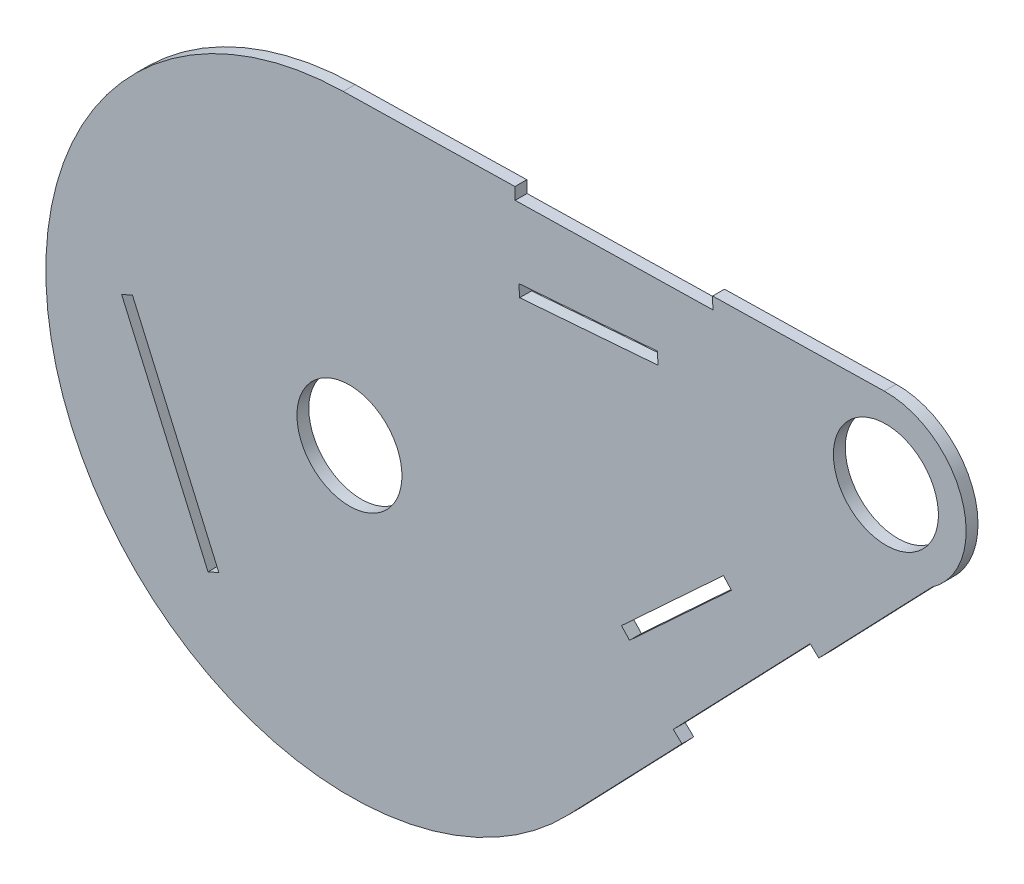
ISO-10303-21;
HEADER;
FILE_DESCRIPTION(('STEP AP214'),'2;1');
FILE_NAME('part.step','',(''),(''),'','','');
FILE_SCHEMA(('AUTOMOTIVE_DESIGN { 1 0 10303 214 1 1 1 1 }'));
ENDSEC;
DATA;
#1=APPLICATION_CONTEXT('core data for automotive mechanical design processes');
#2=APPLICATION_PROTOCOL_DEFINITION('international standard','automotive_design',2000,#1);
#3=PRODUCT_CONTEXT('',#1,'mechanical');
#4=PRODUCT('Part','Part','',(#3));
#5=PRODUCT_RELATED_PRODUCT_CATEGORY('part','',(#4));
#6=PRODUCT_DEFINITION_FORMATION('','',#4);
#7=PRODUCT_DEFINITION_CONTEXT('part definition',#1,'design');
#8=PRODUCT_DEFINITION('design','',#6,#7);
#9=PRODUCT_DEFINITION_SHAPE('','',#8);
#10=(LENGTH_UNIT() NAMED_UNIT(*) SI_UNIT(.MILLI.,.METRE.));
#11=(NAMED_UNIT(*) PLANE_ANGLE_UNIT() SI_UNIT($,.RADIAN.));
#12=(NAMED_UNIT(*) SI_UNIT($,.STERADIAN.) SOLID_ANGLE_UNIT());
#13=UNCERTAINTY_MEASURE_WITH_UNIT(LENGTH_MEASURE(1.E-05),#10,'distance_accuracy_value','');
#14=(GEOMETRIC_REPRESENTATION_CONTEXT(3) GLOBAL_UNCERTAINTY_ASSIGNED_CONTEXT((#13)) GLOBAL_UNIT_ASSIGNED_CONTEXT((#10,
#11,#12)) REPRESENTATION_CONTEXT('',''));
#15=CARTESIAN_POINT('',(0.,0.,0.));
#16=DIRECTION('',(0.,0.,1.));
#17=DIRECTION('',(1.,0.,0.));
#18=AXIS2_PLACEMENT_3D('',#15,#16,#17);
#19=CARTESIAN_POINT('',(9.258899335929,5.40182579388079,1.524));
#20=DIRECTION('',(0.020329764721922,-0.99979332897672,0.));
#21=DIRECTION('',(0.99979332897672,0.020329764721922,0.));
#22=AXIS2_PLACEMENT_3D('',#19,#20,#21);
#23=PLANE('',#22);
#24=DIRECTION('',(-0.99979332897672,-0.020329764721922,0.));
#25=VECTOR('',#24,1.);
#26=CARTESIAN_POINT('',(9.258899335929,5.40182579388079,0.));
#27=LINE('',#26,#25);
#28=CARTESIAN_POINT('',(9.258899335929,5.40182579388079,0.));
#29=VERTEX_POINT('',#28);
#30=CARTESIAN_POINT('',(-12.7962234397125,4.95335765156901,0.));
#31=VERTEX_POINT('',#30);
#32=EDGE_CURVE('E377',#29,#31,#27,.T.);
#33=ORIENTED_EDGE('',*,*,#32,.T.);
#34=DIRECTION('',(0.,0.,1.));
#35=VECTOR('',#34,1.);
#36=CARTESIAN_POINT('',(-12.7962234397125,4.95335765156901,0.));
#37=LINE('',#36,#35);
#38=CARTESIAN_POINT('',(-12.7962234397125,4.95335765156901,1.524));
#39=VERTEX_POINT('',#38);
#40=EDGE_CURVE('E225',#31,#39,#37,.T.);
#41=ORIENTED_EDGE('',*,*,#40,.T.);
#42=DIRECTION('',(-0.99979332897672,-0.020329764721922,0.));
#43=VECTOR('',#42,1.);
#44=CARTESIAN_POINT('',(9.258899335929,5.40182579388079,1.524));
#45=LINE('',#44,#43);
#46=CARTESIAN_POINT('',(9.258899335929,5.40182579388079,1.524));
#47=VERTEX_POINT('',#46);
#48=EDGE_CURVE('E365',#47,#39,#45,.T.);
#49=ORIENTED_EDGE('',*,*,#48,.F.);
#50=DIRECTION('',(0.,0.,-1.));
#51=VECTOR('',#50,1.);
#52=CARTESIAN_POINT('',(9.258899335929,5.40182579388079,1.524));
#53=LINE('',#52,#51);
#54=EDGE_CURVE('E11',#47,#29,#53,.T.);
#55=ORIENTED_EDGE('',*,*,#54,.T.);
#56=EDGE_LOOP('',(#33,#41,#49,#55));
#57=FACE_BOUND('',#56,.T.);
#58=ADVANCED_FACE('F34',(#57),#23,.F.);
#59=CARTESIAN_POINT('',(15.4024708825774,-13.3349100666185,1.524));
#60=DIRECTION('',(-0.721594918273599,0.692315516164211,0.));
#61=DIRECTION('',(-0.692315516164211,-0.721594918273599,0.));
#62=AXIS2_PLACEMENT_3D('',#59,#60,#61);
#63=PLANE('',#62);
#64=DIRECTION('',(0.692315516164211,0.721594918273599,0.));
#65=VECTOR('',#64,1.);
#66=CARTESIAN_POINT('',(15.4024708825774,-13.3349100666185,0.));
#67=LINE('',#66,#65);
#68=CARTESIAN_POINT('',(-31.3049279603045,-62.0176578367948,0.));
#69=VERTEX_POINT('',#68);
#70=CARTESIAN_POINT('',(-16.7436355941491,-46.8405394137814,0.));
#71=VERTEX_POINT('',#70);
#72=EDGE_CURVE('E364',#69,#71,#67,.T.);
#73=ORIENTED_EDGE('',*,*,#72,.T.);
#74=DIRECTION('',(0.,0.,1.));
#75=VECTOR('',#74,1.);
#76=CARTESIAN_POINT('',(-16.7436355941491,-46.8405394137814,0.));
#77=LINE('',#76,#75);
#78=CARTESIAN_POINT('',(-16.7436355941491,-46.8405394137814,1.524));
#79=VERTEX_POINT('',#78);
#80=EDGE_CURVE('E246',#71,#79,#77,.T.);
#81=ORIENTED_EDGE('',*,*,#80,.T.);
#82=DIRECTION('',(0.692315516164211,0.721594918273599,0.));
#83=VECTOR('',#82,1.);
#84=CARTESIAN_POINT('',(15.4024708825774,-13.3349100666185,1.524));
#85=LINE('',#84,#83);
#86=CARTESIAN_POINT('',(-31.3049279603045,-62.0176578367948,1.524));
#87=VERTEX_POINT('',#86);
#88=EDGE_CURVE('E371',#87,#79,#85,.T.);
#89=ORIENTED_EDGE('',*,*,#88,.F.);
#90=DIRECTION('',(0.,0.,-1.));
#91=VECTOR('',#90,1.);
#92=CARTESIAN_POINT('',(-31.3049279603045,-62.0176578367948,1.524));
#93=LINE('',#92,#91);
#94=EDGE_CURVE('E387',#87,#69,#93,.T.);
#95=ORIENTED_EDGE('',*,*,#94,.T.);
#96=EDGE_LOOP('',(#73,#81,#89,#95));
#97=FACE_BOUND('',#96,.T.);
#98=ADVANCED_FACE('F400',(#97),#63,.F.);
#99=CARTESIAN_POINT('',(9.46847857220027,-4.90502847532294,1.524));
#100=DIRECTION('',(0.,0.,1.));
#101=DIRECTION('',(1.,0.,0.));
#102=AXIS2_PLACEMENT_3D('',#99,#100,#101);
#103=PLANE('',#102);
#104=DIRECTION('',(-0.0203297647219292,0.99979332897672,0.));
#105=VECTOR('',#104,1.);
#106=CARTESIAN_POINT('',(-12.7962234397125,4.95335765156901,1.524));
#107=LINE('',#106,#105);
#108=CARTESIAN_POINT('',(-12.7652408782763,3.42967261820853,1.524));
#109=VERTEX_POINT('',#108);
#110=EDGE_CURVE('E217',#109,#39,#107,.T.);
#111=ORIENTED_EDGE('',*,*,#110,.F.);
#112=DIRECTION('',(0.99979332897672,0.0203297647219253,0.));
#113=VECTOR('',#112,1.);
#114=CARTESIAN_POINT('',(-38.159991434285,2.91329659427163,1.524));
#115=LINE('',#114,#113);
#116=CARTESIAN_POINT('',(-38.159991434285,2.91329659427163,1.524));
#117=VERTEX_POINT('',#116);
#118=EDGE_CURVE('E219',#117,#109,#115,.T.);
#119=ORIENTED_EDGE('',*,*,#118,.F.);
#120=DIRECTION('',(0.0203297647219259,-0.99979332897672,0.));
#121=VECTOR('',#120,1.);
#122=CARTESIAN_POINT('',(-38.1909739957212,4.43698162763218,1.524));
#123=LINE('',#122,#121);
#124=CARTESIAN_POINT('',(-38.1909739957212,4.43698162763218,1.524));
#125=VERTEX_POINT('',#124);
#126=EDGE_CURVE('E197',#125,#117,#123,.T.);
#127=ORIENTED_EDGE('',*,*,#126,.F.);
#128=CARTESIAN_POINT('',(-60.2460967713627,3.98851348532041,1.524));
#129=VERTEX_POINT('',#128);
#130=EDGE_CURVE('E363',#125,#129,#45,.T.);
#131=ORIENTED_EDGE('',*,*,#130,.T.);
#132=CARTESIAN_POINT('',(-59.4530686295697,-35.0116548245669,1.524));
#133=DIRECTION('',(0.,0.,1.));
#134=DIRECTION('',(1.,0.,0.));
#135=AXIS2_PLACEMENT_3D('',#132,#133,#134);
#136=CIRCLE('',#135,39.0082301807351);
#137=EDGE_CURVE('E368',#129,#87,#136,.T.);
#138=ORIENTED_EDGE('',*,*,#137,.T.);
#139=ORIENTED_EDGE('',*,*,#88,.T.);
#140=DIRECTION('',(0.721594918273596,-0.692315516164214,0.));
#141=VECTOR('',#140,1.);
#142=CARTESIAN_POINT('',(-16.7436355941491,-46.8405394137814,1.524));
#143=LINE('',#142,#141);
#144=CARTESIAN_POINT('',(-17.843346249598,-45.7854505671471,1.524));
#145=VERTEX_POINT('',#144);
#146=EDGE_CURVE('E233',#145,#79,#143,.T.);
#147=ORIENTED_EDGE('',*,*,#146,.F.);
#148=DIRECTION('',(-0.692315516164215,-0.721594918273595,0.));
#149=VECTOR('',#148,1.);
#150=CARTESIAN_POINT('',(-0.258532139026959,-27.4569396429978,1.524));
#151=LINE('',#150,#149);
#152=CARTESIAN_POINT('',(-0.258532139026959,-27.4569396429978,1.524));
#153=VERTEX_POINT('',#152);
#154=EDGE_CURVE('E242',#153,#145,#151,.T.);
#155=ORIENTED_EDGE('',*,*,#154,.F.);
#156=DIRECTION('',(-0.721594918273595,0.692315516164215,0.));
#157=VECTOR('',#156,1.);
#158=CARTESIAN_POINT('',(0.841178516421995,-28.512028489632,1.524));
#159=LINE('',#158,#157);
#160=CARTESIAN_POINT('',(0.841178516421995,-28.512028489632,1.524));
#161=VERTEX_POINT('',#160);
#162=EDGE_CURVE('E228',#161,#153,#159,.T.);
#163=ORIENTED_EDGE('',*,*,#162,.F.);
#164=CARTESIAN_POINT('',(15.4024708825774,-13.3349100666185,1.524));
#165=VERTEX_POINT('',#164);
#166=EDGE_CURVE('E370',#161,#165,#85,.T.);
#167=ORIENTED_EDGE('',*,*,#166,.T.);
#168=CARTESIAN_POINT('',(9.46847857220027,-4.90502847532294,1.524));
#169=DIRECTION('',(0.,0.,1.));
#170=DIRECTION('',(1.,0.,0.));
#171=AXIS2_PLACEMENT_3D('',#168,#169,#170);
#172=CIRCLE('',#171,10.3089848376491);
#173=EDGE_CURVE('E360',#165,#47,#172,.T.);
#174=ORIENTED_EDGE('',*,*,#173,.T.);
#175=ORIENTED_EDGE('',*,*,#48,.T.);
#176=EDGE_LOOP('',(#111,#119,#127,#131,#138,#139,#147,#155,#163,#167,#174,#175));
#177=FACE_BOUND('',#176,.T.);
#178=DIRECTION('',(-0.734074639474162,-0.679068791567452,0.));
#179=VECTOR('',#178,1.);
#180=CARTESIAN_POINT('',(-11.4028544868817,-25.4543079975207,1.524));
#181=LINE('',#180,#179);
#182=CARTESIAN_POINT('',(-11.4028544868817,-25.4543079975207,1.524));
#183=VERTEX_POINT('',#182);
#184=CARTESIAN_POINT('',(-24.5028269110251,-37.5726703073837,1.524));
#185=VERTEX_POINT('',#184);
#186=EDGE_CURVE('E288',#183,#185,#181,.T.);
#187=ORIENTED_EDGE('',*,*,#186,.F.);
#188=DIRECTION('',(-0.679068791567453,0.734074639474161,0.));
#189=VECTOR('',#188,1.);
#190=CARTESIAN_POINT('',(-11.4028544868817,-25.4543079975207,1.524));
#191=LINE('',#190,#189);
#192=CARTESIAN_POINT('',(-10.3679536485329,-26.5730377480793,1.524));
#193=VERTEX_POINT('',#192);
#194=EDGE_CURVE('E286',#193,#183,#191,.T.);
#195=ORIENTED_EDGE('',*,*,#194,.F.);
#196=DIRECTION('',(0.734074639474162,0.679068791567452,0.));
#197=VECTOR('',#196,1.);
#198=CARTESIAN_POINT('',(-10.3679536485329,-26.5730377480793,1.524));
#199=LINE('',#198,#197);
#200=CARTESIAN_POINT('',(-23.4679260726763,-38.6914000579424,1.524));
#201=VERTEX_POINT('',#200);
#202=EDGE_CURVE('E294',#201,#193,#199,.T.);
#203=ORIENTED_EDGE('',*,*,#202,.F.);
#204=DIRECTION('',(0.679068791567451,-0.734074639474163,0.));
#205=VECTOR('',#204,1.);
#206=CARTESIAN_POINT('',(-24.5028269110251,-37.5726703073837,1.524));
#207=LINE('',#206,#205);
#208=EDGE_CURVE('E291',#185,#201,#207,.T.);
#209=ORIENTED_EDGE('',*,*,#208,.F.);
#210=EDGE_LOOP('',(#187,#195,#203,#209));
#211=FACE_BOUND('',#210,.T.);
#212=DIRECTION('',(-0.0771168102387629,0.997022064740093,0.));
#213=VECTOR('',#212,1.);
#214=CARTESIAN_POINT('',(-19.7901339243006,-6.2537416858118,1.524));
#215=LINE('',#214,#213);
#216=CARTESIAN_POINT('',(-19.7901339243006,-6.2537416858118,1.524));
#217=VERTEX_POINT('',#216);
#218=CARTESIAN_POINT('',(-19.9076599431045,-4.73428005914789,1.524));
#219=VERTEX_POINT('',#218);
#220=EDGE_CURVE('E325',#217,#219,#215,.T.);
#221=ORIENTED_EDGE('',*,*,#220,.F.);
#222=DIRECTION('',(0.997022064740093,0.0771168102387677,0.));
#223=VECTOR('',#222,1.);
#224=CARTESIAN_POINT('',(-19.7901339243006,-6.2537416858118,1.524));
#225=LINE('',#224,#223);
#226=CARTESIAN_POINT('',(-37.5825501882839,-7.62993428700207,1.524));
#227=VERTEX_POINT('',#226);
#228=EDGE_CURVE('E323',#227,#217,#225,.T.);
#229=ORIENTED_EDGE('',*,*,#228,.F.);
#230=DIRECTION('',(0.0771168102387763,-0.997022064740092,0.));
#231=VECTOR('',#230,1.);
#232=CARTESIAN_POINT('',(-37.5825501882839,-7.62993428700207,1.524));
#233=LINE('',#232,#231);
#234=CARTESIAN_POINT('',(-37.7000762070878,-6.11047266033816,1.524));
#235=VERTEX_POINT('',#234);
#236=EDGE_CURVE('E331',#235,#227,#233,.T.);
#237=ORIENTED_EDGE('',*,*,#236,.F.);
#238=DIRECTION('',(-0.997022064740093,-0.0771168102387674,0.));
#239=VECTOR('',#238,1.);
#240=CARTESIAN_POINT('',(-19.9076599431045,-4.73428005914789,1.524));
#241=LINE('',#240,#239);
#242=EDGE_CURVE('E328',#219,#235,#241,.T.);
#243=ORIENTED_EDGE('',*,*,#242,.F.);
#244=EDGE_LOOP('',(#221,#229,#237,#243));
#245=FACE_BOUND('',#244,.T.);
#246=CARTESIAN_POINT('',(9.46847857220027,-4.90502847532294,1.524));
#247=DIRECTION('',(0.,0.,1.));
#248=DIRECTION('',(1.,0.,0.));
#249=AXIS2_PLACEMENT_3D('',#246,#247,#248);
#250=CIRCLE('',#249,6.7437);
#251=CARTESIAN_POINT('',(2.72477857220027,-4.90502847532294,1.524));
#252=VERTEX_POINT('',#251);
#253=EDGE_CURVE('E354',#252,#252,#250,.T.);
#254=ORIENTED_EDGE('',*,*,#253,.F.);
#255=EDGE_LOOP('',(#254));
#256=FACE_BOUND('',#255,.T.);
#257=CARTESIAN_POINT('',(-59.4530686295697,-35.0116548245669,1.524));
#258=DIRECTION('',(0.,0.,1.));
#259=DIRECTION('',(1.,0.,0.));
#260=AXIS2_PLACEMENT_3D('',#257,#258,#259);
#261=CIRCLE('',#260,6.7437);
#262=CARTESIAN_POINT('',(-66.1967686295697,-35.0116548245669,1.524));
#263=VERTEX_POINT('',#262);
#264=EDGE_CURVE('E317',#263,#263,#261,.T.);
#265=ORIENTED_EDGE('',*,*,#264,.F.);
#266=EDGE_LOOP('',(#265));
#267=FACE_BOUND('',#266,.T.);
#268=DIRECTION('',(0.401557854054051,-0.915833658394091,0.));
#269=VECTOR('',#268,1.);
#270=CARTESIAN_POINT('',(-88.7233799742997,-32.8297260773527,1.524));
#271=LINE('',#270,#269);
#272=CARTESIAN_POINT('',(-88.7233799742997,-32.8297260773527,1.524));
#273=VERTEX_POINT('',#272);
#274=CARTESIAN_POINT('',(-77.6222617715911,-58.1480646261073,1.524));
#275=VERTEX_POINT('',#274);
#276=EDGE_CURVE('E257',#273,#275,#271,.T.);
#277=ORIENTED_EDGE('',*,*,#276,.F.);
#278=DIRECTION('',(-0.915833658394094,-0.401557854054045,0.));
#279=VECTOR('',#278,1.);
#280=CARTESIAN_POINT('',(-88.7233799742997,-32.8297260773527,1.524));
#281=LINE('',#280,#279);
#282=CARTESIAN_POINT('',(-87.3276494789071,-32.2177519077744,1.524));
#283=VERTEX_POINT('',#282);
#284=EDGE_CURVE('E255',#283,#273,#281,.T.);
#285=ORIENTED_EDGE('',*,*,#284,.F.);
#286=DIRECTION('',(-0.401557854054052,0.915833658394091,0.));
#287=VECTOR('',#286,1.);
#288=CARTESIAN_POINT('',(-87.3276494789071,-32.2177519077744,1.524));
#289=LINE('',#288,#287);
#290=CARTESIAN_POINT('',(-76.2265312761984,-57.536090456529,1.524));
#291=VERTEX_POINT('',#290);
#292=EDGE_CURVE('E263',#291,#283,#289,.T.);
#293=ORIENTED_EDGE('',*,*,#292,.F.);
#294=DIRECTION('',(0.915833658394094,0.401557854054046,0.));
#295=VECTOR('',#294,1.);
#296=CARTESIAN_POINT('',(-77.6222617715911,-58.1480646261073,1.524));
#297=LINE('',#296,#295);
#298=EDGE_CURVE('E260',#275,#291,#297,.T.);
#299=ORIENTED_EDGE('',*,*,#298,.F.);
#300=EDGE_LOOP('',(#277,#285,#293,#299));
#301=FACE_BOUND('',#300,.T.);
#302=ADVANCED_FACE('F405',(#177,#211,#245,#256,#267,#301),#103,.T.);
#303=CARTESIAN_POINT('',(9.46847857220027,-4.90502847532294,0.));
#304=DIRECTION('',(0.,0.,1.));
#305=DIRECTION('',(1.,0.,0.));
#306=AXIS2_PLACEMENT_3D('',#303,#304,#305);
#307=PLANE('',#306);
#308=DIRECTION('',(-0.679068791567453,0.734074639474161,0.));
#309=VECTOR('',#308,1.);
#310=CARTESIAN_POINT('',(-11.4028544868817,-25.4543079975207,0.));
#311=LINE('',#310,#309);
#312=CARTESIAN_POINT('',(-10.3679536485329,-26.5730377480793,0.));
#313=VERTEX_POINT('',#312);
#314=CARTESIAN_POINT('',(-11.4028544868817,-25.4543079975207,0.));
#315=VERTEX_POINT('',#314);
#316=EDGE_CURVE('E285',#313,#315,#311,.T.);
#317=ORIENTED_EDGE('',*,*,#316,.T.);
#318=DIRECTION('',(-0.734074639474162,-0.679068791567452,0.));
#319=VECTOR('',#318,1.);
#320=CARTESIAN_POINT('',(-11.4028544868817,-25.4543079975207,0.));
#321=LINE('',#320,#319);
#322=CARTESIAN_POINT('',(-24.5028269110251,-37.5726703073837,0.));
#323=VERTEX_POINT('',#322);
#324=EDGE_CURVE('E299',#315,#323,#321,.T.);
#325=ORIENTED_EDGE('',*,*,#324,.T.);
#326=DIRECTION('',(0.679068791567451,-0.734074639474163,0.));
#327=VECTOR('',#326,1.);
#328=CARTESIAN_POINT('',(-24.5028269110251,-37.5726703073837,0.));
#329=LINE('',#328,#327);
#330=CARTESIAN_POINT('',(-23.4679260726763,-38.6914000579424,0.));
#331=VERTEX_POINT('',#330);
#332=EDGE_CURVE('E302',#323,#331,#329,.T.);
#333=ORIENTED_EDGE('',*,*,#332,.T.);
#334=DIRECTION('',(0.734074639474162,0.679068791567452,0.));
#335=VECTOR('',#334,1.);
#336=CARTESIAN_POINT('',(-10.3679536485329,-26.5730377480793,0.));
#337=LINE('',#336,#335);
#338=EDGE_CURVE('E289',#331,#313,#337,.T.);
#339=ORIENTED_EDGE('',*,*,#338,.T.);
#340=EDGE_LOOP('',(#317,#325,#333,#339));
#341=FACE_BOUND('',#340,.T.);
#342=DIRECTION('',(0.997022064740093,0.0771168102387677,0.));
#343=VECTOR('',#342,1.);
#344=CARTESIAN_POINT('',(-19.7901339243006,-6.2537416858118,0.));
#345=LINE('',#344,#343);
#346=CARTESIAN_POINT('',(-37.5825501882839,-7.62993428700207,0.));
#347=VERTEX_POINT('',#346);
#348=CARTESIAN_POINT('',(-19.7901339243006,-6.2537416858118,0.));
#349=VERTEX_POINT('',#348);
#350=EDGE_CURVE('E320',#347,#349,#345,.T.);
#351=ORIENTED_EDGE('',*,*,#350,.T.);
#352=DIRECTION('',(-0.0771168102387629,0.997022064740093,0.));
#353=VECTOR('',#352,1.);
#354=CARTESIAN_POINT('',(-19.7901339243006,-6.2537416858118,0.));
#355=LINE('',#354,#353);
#356=CARTESIAN_POINT('',(-19.9076599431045,-4.73428005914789,0.));
#357=VERTEX_POINT('',#356);
#358=EDGE_CURVE('E336',#349,#357,#355,.T.);
#359=ORIENTED_EDGE('',*,*,#358,.T.);
#360=DIRECTION('',(-0.997022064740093,-0.0771168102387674,0.));
#361=VECTOR('',#360,1.);
#362=CARTESIAN_POINT('',(-19.9076599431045,-4.73428005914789,0.));
#363=LINE('',#362,#361);
#364=CARTESIAN_POINT('',(-37.7000762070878,-6.11047266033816,0.));
#365=VERTEX_POINT('',#364);
#366=EDGE_CURVE('E339',#357,#365,#363,.T.);
#367=ORIENTED_EDGE('',*,*,#366,.T.);
#368=DIRECTION('',(0.0771168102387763,-0.997022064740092,0.));
#369=VECTOR('',#368,1.);
#370=CARTESIAN_POINT('',(-37.5825501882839,-7.62993428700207,0.));
#371=LINE('',#370,#369);
#372=EDGE_CURVE('E326',#365,#347,#371,.T.);
#373=ORIENTED_EDGE('',*,*,#372,.T.);
#374=EDGE_LOOP('',(#351,#359,#367,#373));
#375=FACE_BOUND('',#374,.T.);
#376=DIRECTION('',(0.99979332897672,0.0203297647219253,0.));
#377=VECTOR('',#376,1.);
#378=CARTESIAN_POINT('',(-38.159991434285,2.91329659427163,0.));
#379=LINE('',#378,#377);
#380=CARTESIAN_POINT('',(-38.159991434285,2.91329659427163,0.));
#381=VERTEX_POINT('',#380);
#382=CARTESIAN_POINT('',(-12.7652408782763,3.42967261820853,0.));
#383=VERTEX_POINT('',#382);
#384=EDGE_CURVE('E205',#381,#383,#379,.T.);
#385=ORIENTED_EDGE('',*,*,#384,.T.);
#386=DIRECTION('',(-0.0203297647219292,0.99979332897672,0.));
#387=VECTOR('',#386,1.);
#388=CARTESIAN_POINT('',(-12.7962234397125,4.95335765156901,0.));
#389=LINE('',#388,#387);
#390=EDGE_CURVE('E210',#383,#31,#389,.T.);
#391=ORIENTED_EDGE('',*,*,#390,.T.);
#392=ORIENTED_EDGE('',*,*,#32,.F.);
#393=CARTESIAN_POINT('',(9.46847857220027,-4.90502847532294,0.));
#394=DIRECTION('',(0.,0.,1.));
#395=DIRECTION('',(1.,0.,0.));
#396=AXIS2_PLACEMENT_3D('',#393,#394,#395);
#397=CIRCLE('',#396,10.3089848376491);
#398=CARTESIAN_POINT('',(15.4024708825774,-13.3349100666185,0.));
#399=VERTEX_POINT('',#398);
#400=EDGE_CURVE('E357',#399,#29,#397,.T.);
#401=ORIENTED_EDGE('',*,*,#400,.F.);
#402=CARTESIAN_POINT('',(0.841178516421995,-28.5120284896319,0.));
#403=VERTEX_POINT('',#402);
#404=EDGE_CURVE('E382',#403,#399,#67,.T.);
#405=ORIENTED_EDGE('',*,*,#404,.F.);
#406=DIRECTION('',(-0.721594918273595,0.692315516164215,0.));
#407=VECTOR('',#406,1.);
#408=CARTESIAN_POINT('',(0.841178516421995,-28.512028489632,0.));
#409=LINE('',#408,#407);
#410=CARTESIAN_POINT('',(-0.258532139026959,-27.4569396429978,0.));
#411=VERTEX_POINT('',#410);
#412=EDGE_CURVE('E57',#403,#411,#409,.T.);
#413=ORIENTED_EDGE('',*,*,#412,.T.);
#414=DIRECTION('',(-0.692315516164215,-0.721594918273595,0.));
#415=VECTOR('',#414,1.);
#416=CARTESIAN_POINT('',(-0.258532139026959,-27.4569396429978,0.));
#417=LINE('',#416,#415);
#418=CARTESIAN_POINT('',(-17.843346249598,-45.7854505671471,0.));
#419=VERTEX_POINT('',#418);
#420=EDGE_CURVE('E232',#411,#419,#417,.T.);
#421=ORIENTED_EDGE('',*,*,#420,.T.);
#422=DIRECTION('',(0.721594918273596,-0.692315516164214,0.));
#423=VECTOR('',#422,1.);
#424=CARTESIAN_POINT('',(-16.7436355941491,-46.8405394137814,0.));
#425=LINE('',#424,#423);
#426=EDGE_CURVE('E236',#419,#71,#425,.T.);
#427=ORIENTED_EDGE('',*,*,#426,.T.);
#428=ORIENTED_EDGE('',*,*,#72,.F.);
#429=CARTESIAN_POINT('',(-59.4530686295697,-35.0116548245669,0.));
#430=DIRECTION('',(0.,0.,1.));
#431=DIRECTION('',(1.,0.,0.));
#432=AXIS2_PLACEMENT_3D('',#429,#430,#431);
#433=CIRCLE('',#432,39.0082301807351);
#434=CARTESIAN_POINT('',(-60.2460967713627,3.98851348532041,0.));
#435=VERTEX_POINT('',#434);
#436=EDGE_CURVE('E380',#435,#69,#433,.T.);
#437=ORIENTED_EDGE('',*,*,#436,.F.);
#438=CARTESIAN_POINT('',(-38.1909739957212,4.4369816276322,0.));
#439=VERTEX_POINT('',#438);
#440=EDGE_CURVE('E216',#439,#435,#27,.T.);
#441=ORIENTED_EDGE('',*,*,#440,.F.);
#442=DIRECTION('',(0.0203297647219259,-0.99979332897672,0.));
#443=VECTOR('',#442,1.);
#444=CARTESIAN_POINT('',(-38.1909739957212,4.43698162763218,0.));
#445=LINE('',#444,#443);
#446=EDGE_CURVE('E49',#439,#381,#445,.T.);
#447=ORIENTED_EDGE('',*,*,#446,.T.);
#448=EDGE_LOOP('',(#385,#391,#392,#401,#405,#413,#421,#427,#428,#437,#441,#447));
#449=FACE_BOUND('',#448,.T.);
#450=CARTESIAN_POINT('',(9.46847857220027,-4.90502847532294,0.));
#451=DIRECTION('',(0.,0.,1.));
#452=DIRECTION('',(1.,0.,0.));
#453=AXIS2_PLACEMENT_3D('',#450,#451,#452);
#454=CIRCLE('',#453,6.7437);
#455=CARTESIAN_POINT('',(2.72477857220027,-4.90502847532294,0.));
#456=VERTEX_POINT('',#455);
#457=EDGE_CURVE('E353',#456,#456,#454,.T.);
#458=ORIENTED_EDGE('',*,*,#457,.T.);
#459=EDGE_LOOP('',(#458));
#460=FACE_BOUND('',#459,.T.);
#461=CARTESIAN_POINT('',(-59.4530686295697,-35.0116548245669,0.));
#462=DIRECTION('',(0.,0.,1.));
#463=DIRECTION('',(1.,0.,0.));
#464=AXIS2_PLACEMENT_3D('',#461,#462,#463);
#465=CIRCLE('',#464,6.7437);
#466=CARTESIAN_POINT('',(-66.1967686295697,-35.0116548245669,0.));
#467=VERTEX_POINT('',#466);
#468=EDGE_CURVE('E316',#467,#467,#465,.T.);
#469=ORIENTED_EDGE('',*,*,#468,.T.);
#470=EDGE_LOOP('',(#469));
#471=FACE_BOUND('',#470,.T.);
#472=DIRECTION('',(-0.915833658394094,-0.401557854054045,0.));
#473=VECTOR('',#472,1.);
#474=CARTESIAN_POINT('',(-88.7233799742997,-32.8297260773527,0.));
#475=LINE('',#474,#473);
#476=CARTESIAN_POINT('',(-87.3276494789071,-32.2177519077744,0.));
#477=VERTEX_POINT('',#476);
#478=CARTESIAN_POINT('',(-88.7233799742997,-32.8297260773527,0.));
#479=VERTEX_POINT('',#478);
#480=EDGE_CURVE('E249',#477,#479,#475,.T.);
#481=ORIENTED_EDGE('',*,*,#480,.T.);
#482=DIRECTION('',(0.401557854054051,-0.915833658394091,0.));
#483=VECTOR('',#482,1.);
#484=CARTESIAN_POINT('',(-88.7233799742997,-32.8297260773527,0.));
#485=LINE('',#484,#483);
#486=CARTESIAN_POINT('',(-77.6222617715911,-58.1480646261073,0.));
#487=VERTEX_POINT('',#486);
#488=EDGE_CURVE('E268',#479,#487,#485,.T.);
#489=ORIENTED_EDGE('',*,*,#488,.T.);
#490=DIRECTION('',(0.915833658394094,0.401557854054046,0.));
#491=VECTOR('',#490,1.);
#492=CARTESIAN_POINT('',(-77.6222617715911,-58.1480646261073,0.));
#493=LINE('',#492,#491);
#494=CARTESIAN_POINT('',(-76.2265312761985,-57.536090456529,0.));
#495=VERTEX_POINT('',#494);
#496=EDGE_CURVE('E271',#487,#495,#493,.T.);
#497=ORIENTED_EDGE('',*,*,#496,.T.);
#498=DIRECTION('',(-0.401557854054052,0.915833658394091,0.));
#499=VECTOR('',#498,1.);
#500=CARTESIAN_POINT('',(-87.3276494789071,-32.2177519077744,0.));
#501=LINE('',#500,#499);
#502=EDGE_CURVE('E258',#495,#477,#501,.T.);
#503=ORIENTED_EDGE('',*,*,#502,.T.);
#504=EDGE_LOOP('',(#481,#489,#497,#503));
#505=FACE_BOUND('',#504,.T.);
#506=ADVANCED_FACE('F213',(#341,#375,#449,#460,#471,#505),#307,.F.);
#507=CARTESIAN_POINT('',(9.46847857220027,-4.90502847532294,1.524));
#508=DIRECTION('',(0.,0.,-1.));
#509=DIRECTION('',(-1.,0.,0.));
#510=AXIS2_PLACEMENT_3D('',#507,#508,#509);
#511=CYLINDRICAL_SURFACE('',#510,10.3089848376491);
#512=ORIENTED_EDGE('',*,*,#400,.T.);
#513=ORIENTED_EDGE('',*,*,#54,.F.);
#514=ORIENTED_EDGE('',*,*,#173,.F.);
#515=DIRECTION('',(0.,0.,-1.));
#516=VECTOR('',#515,1.);
#517=CARTESIAN_POINT('',(15.4024708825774,-13.3349100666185,1.524));
#518=LINE('',#517,#516);
#519=EDGE_CURVE('E374',#165,#399,#518,.T.);
#520=ORIENTED_EDGE('',*,*,#519,.T.);
#521=EDGE_LOOP('',(#512,#513,#514,#520));
#522=FACE_BOUND('',#521,.T.);
#523=ADVANCED_FACE('F36',(#522),#511,.T.);
#524=ORIENTED_EDGE('',*,*,#130,.F.);
#525=DIRECTION('',(0.,0.,1.));
#526=VECTOR('',#525,1.);
#527=CARTESIAN_POINT('',(-38.1909739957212,4.43698162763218,0.));
#528=LINE('',#527,#526);
#529=EDGE_CURVE('E202',#439,#125,#528,.T.);
#530=ORIENTED_EDGE('',*,*,#529,.F.);
#531=ORIENTED_EDGE('',*,*,#440,.T.);
#532=DIRECTION('',(0.,0.,-1.));
#533=VECTOR('',#532,1.);
#534=CARTESIAN_POINT('',(-60.2460967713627,3.98851348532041,1.524));
#535=LINE('',#534,#533);
#536=EDGE_CURVE('E42',#129,#435,#535,.T.);
#537=ORIENTED_EDGE('',*,*,#536,.F.);
#538=EDGE_LOOP('',(#524,#530,#531,#537));
#539=FACE_BOUND('',#538,.T.);
#540=ADVANCED_FACE('F408',(#539),#23,.F.);
#541=CARTESIAN_POINT('',(-59.4530686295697,-35.0116548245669,1.524));
#542=DIRECTION('',(0.,0.,-1.));
#543=DIRECTION('',(-1.,0.,0.));
#544=AXIS2_PLACEMENT_3D('',#541,#542,#543);
#545=CYLINDRICAL_SURFACE('',#544,39.0082301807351);
#546=ORIENTED_EDGE('',*,*,#436,.T.);
#547=ORIENTED_EDGE('',*,*,#94,.F.);
#548=ORIENTED_EDGE('',*,*,#137,.F.);
#549=ORIENTED_EDGE('',*,*,#536,.T.);
#550=EDGE_LOOP('',(#546,#547,#548,#549));
#551=FACE_BOUND('',#550,.T.);
#552=ADVANCED_FACE('F393',(#551),#545,.T.);
#553=ORIENTED_EDGE('',*,*,#166,.F.);
#554=DIRECTION('',(0.,0.,1.));
#555=VECTOR('',#554,1.);
#556=CARTESIAN_POINT('',(0.841178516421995,-28.512028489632,0.));
#557=LINE('',#556,#555);
#558=EDGE_CURVE('E239',#403,#161,#557,.T.);
#559=ORIENTED_EDGE('',*,*,#558,.F.);
#560=ORIENTED_EDGE('',*,*,#404,.T.);
#561=ORIENTED_EDGE('',*,*,#519,.F.);
#562=EDGE_LOOP('',(#553,#559,#560,#561));
#563=FACE_BOUND('',#562,.T.);
#564=ADVANCED_FACE('F414',(#563),#63,.F.);
#565=CARTESIAN_POINT('',(9.46847857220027,-4.90502847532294,1.524));
#566=DIRECTION('',(0.,0.,-1.));
#567=DIRECTION('',(-1.,0.,0.));
#568=AXIS2_PLACEMENT_3D('',#565,#566,#567);
#569=CYLINDRICAL_SURFACE('',#568,6.7437);
#570=CARTESIAN_POINT('',(2.72477857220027,-4.90502847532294,1.524));
#571=CARTESIAN_POINT('',(2.72477857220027,-4.90502847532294,1.508125));
#572=CARTESIAN_POINT('',(2.72477857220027,-4.90502847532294,1.49225));
#573=CARTESIAN_POINT('',(2.72477857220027,-4.90502847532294,1.4605));
#574=CARTESIAN_POINT('',(2.72477857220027,-4.90502847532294,1.444625));
#575=CARTESIAN_POINT('',(2.72477857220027,-4.90502847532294,1.412875));
#576=CARTESIAN_POINT('',(2.72477857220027,-4.90502847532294,1.397));
#577=CARTESIAN_POINT('',(2.72477857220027,-4.90502847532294,1.36525));
#578=CARTESIAN_POINT('',(2.72477857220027,-4.90502847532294,1.349375));
#579=CARTESIAN_POINT('',(2.72477857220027,-4.90502847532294,1.317625));
#580=CARTESIAN_POINT('',(2.72477857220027,-4.90502847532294,1.30175));
#581=CARTESIAN_POINT('',(2.72477857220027,-4.90502847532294,1.27));
#582=CARTESIAN_POINT('',(2.72477857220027,-4.90502847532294,1.254125));
#583=CARTESIAN_POINT('',(2.72477857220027,-4.90502847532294,1.222375));
#584=CARTESIAN_POINT('',(2.72477857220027,-4.90502847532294,1.2065));
#585=CARTESIAN_POINT('',(2.72477857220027,-4.90502847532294,1.17475));
#586=CARTESIAN_POINT('',(2.72477857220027,-4.90502847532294,1.158875));
#587=CARTESIAN_POINT('',(2.72477857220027,-4.90502847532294,1.127125));
#588=CARTESIAN_POINT('',(2.72477857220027,-4.90502847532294,1.11125));
#589=CARTESIAN_POINT('',(2.72477857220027,-4.90502847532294,1.0795));
#590=CARTESIAN_POINT('',(2.72477857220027,-4.90502847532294,1.063625));
#591=CARTESIAN_POINT('',(2.72477857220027,-4.90502847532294,1.031875));
#592=CARTESIAN_POINT('',(2.72477857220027,-4.90502847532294,1.016));
#593=CARTESIAN_POINT('',(2.72477857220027,-4.90502847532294,0.98425));
#594=CARTESIAN_POINT('',(2.72477857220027,-4.90502847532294,0.968375));
#595=CARTESIAN_POINT('',(2.72477857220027,-4.90502847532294,0.936625));
#596=CARTESIAN_POINT('',(2.72477857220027,-4.90502847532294,0.92075));
#597=CARTESIAN_POINT('',(2.72477857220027,-4.90502847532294,0.889));
#598=CARTESIAN_POINT('',(2.72477857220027,-4.90502847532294,0.873125));
#599=CARTESIAN_POINT('',(2.72477857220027,-4.90502847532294,0.841375));
#600=CARTESIAN_POINT('',(2.72477857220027,-4.90502847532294,0.8255));
#601=CARTESIAN_POINT('',(2.72477857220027,-4.90502847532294,0.79375));
#602=CARTESIAN_POINT('',(2.72477857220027,-4.90502847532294,0.777875));
#603=CARTESIAN_POINT('',(2.72477857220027,-4.90502847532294,0.746125));
#604=CARTESIAN_POINT('',(2.72477857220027,-4.90502847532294,0.73025));
#605=CARTESIAN_POINT('',(2.72477857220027,-4.90502847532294,0.6985));
#606=CARTESIAN_POINT('',(2.72477857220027,-4.90502847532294,0.682625));
#607=CARTESIAN_POINT('',(2.72477857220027,-4.90502847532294,0.650875));
#608=CARTESIAN_POINT('',(2.72477857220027,-4.90502847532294,0.635));
#609=CARTESIAN_POINT('',(2.72477857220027,-4.90502847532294,0.60325));
#610=CARTESIAN_POINT('',(2.72477857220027,-4.90502847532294,0.587375));
#611=CARTESIAN_POINT('',(2.72477857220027,-4.90502847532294,0.555625));
#612=CARTESIAN_POINT('',(2.72477857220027,-4.90502847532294,0.53975));
#613=CARTESIAN_POINT('',(2.72477857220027,-4.90502847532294,0.508));
#614=CARTESIAN_POINT('',(2.72477857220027,-4.90502847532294,0.492125));
#615=CARTESIAN_POINT('',(2.72477857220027,-4.90502847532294,0.460375));
#616=CARTESIAN_POINT('',(2.72477857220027,-4.90502847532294,0.4445));
#617=CARTESIAN_POINT('',(2.72477857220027,-4.90502847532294,0.41275));
#618=CARTESIAN_POINT('',(2.72477857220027,-4.90502847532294,0.396875));
#619=CARTESIAN_POINT('',(2.72477857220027,-4.90502847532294,0.365125));
#620=CARTESIAN_POINT('',(2.72477857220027,-4.90502847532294,0.34925));
#621=CARTESIAN_POINT('',(2.72477857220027,-4.90502847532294,0.3175));
#622=CARTESIAN_POINT('',(2.72477857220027,-4.90502847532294,0.301625));
#623=CARTESIAN_POINT('',(2.72477857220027,-4.90502847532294,0.269875));
#624=CARTESIAN_POINT('',(2.72477857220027,-4.90502847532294,0.254));
#625=CARTESIAN_POINT('',(2.72477857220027,-4.90502847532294,0.22225));
#626=CARTESIAN_POINT('',(2.72477857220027,-4.90502847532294,0.206375));
#627=CARTESIAN_POINT('',(2.72477857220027,-4.90502847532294,0.174625));
#628=CARTESIAN_POINT('',(2.72477857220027,-4.90502847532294,0.15875));
#629=CARTESIAN_POINT('',(2.72477857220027,-4.90502847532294,0.127));
#630=CARTESIAN_POINT('',(2.72477857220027,-4.90502847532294,0.111125));
#631=CARTESIAN_POINT('',(2.72477857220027,-4.90502847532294,0.079375));
#632=CARTESIAN_POINT('',(2.72477857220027,-4.90502847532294,0.0635));
#633=CARTESIAN_POINT('',(2.72477857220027,-4.90502847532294,0.0317499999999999));
#634=CARTESIAN_POINT('',(2.72477857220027,-4.90502847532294,0.015875));
#635=CARTESIAN_POINT('',(2.72477857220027,-4.90502847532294,0.));
#636=B_SPLINE_CURVE_WITH_KNOTS('',3,(#570,#571,#572,#573,#574,#575,#576,#577,#578,#579,#580,
#581,#582,#583,#584,#585,#586,#587,#588,#589,#590,#591,#592,#593,#594,#595,#596,#597,#598,#599,
#600,#601,#602,#603,#604,#605,#606,#607,#608,#609,#610,#611,#612,#613,#614,#615,#616,#617,#618,
#619,#620,#621,#622,#623,#624,#625,#626,#627,#628,#629,#630,#631,#632,#633,#634,#635),
.UNSPECIFIED.,.F.,.F.,(4,2,2,2,2,2,2,2,2,2,2,2,2,2,2,2,2,2,2,2,2,2,2,2,2,2,2,2,2,2,2,2,4),(0.,
0.0476249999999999,0.0952499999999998,0.142875,0.1905,0.238125,0.28575,0.333375,0.381,0.428625,
0.47625,0.523875,0.5715,0.619125,0.66675,0.714375,0.762,0.809625,0.85725,0.904875,0.9525,
1.000125,1.04775,1.095375,1.143,1.190625,1.23825,1.285875,1.3335,1.381125,1.42875,1.476375,
1.524),.UNSPECIFIED.);
#637=EDGE_CURVE('BSEAM501',#252,#456,#636,.T.);
#638=ORIENTED_EDGE('',*,*,#253,.T.);
#639=ORIENTED_EDGE('',*,*,#457,.F.);
#640=ORIENTED_EDGE('',*,*,#637,.T.);
#641=ORIENTED_EDGE('',*,*,#637,.F.);
#642=EDGE_LOOP('',(#638,#640,#639,#641));
#643=FACE_BOUND('',#642,.T.);
#644=ADVANCED_FACE('F501',(#643),#569,.F.);
#645=CARTESIAN_POINT('',(-19.7901339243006,-6.2537416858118,1.524));
#646=DIRECTION('',(-0.0771168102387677,0.997022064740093,0.));
#647=DIRECTION('',(-0.997022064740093,-0.0771168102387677,0.));
#648=AXIS2_PLACEMENT_3D('',#645,#646,#647);
#649=PLANE('',#648);
#650=ORIENTED_EDGE('',*,*,#350,.F.);
#651=DIRECTION('',(0.,0.,-1.));
#652=VECTOR('',#651,1.);
#653=CARTESIAN_POINT('',(-37.5825501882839,-7.62993428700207,1.524));
#654=LINE('',#653,#652);
#655=EDGE_CURVE('E333',#227,#347,#654,.T.);
#656=ORIENTED_EDGE('',*,*,#655,.F.);
#657=ORIENTED_EDGE('',*,*,#228,.T.);
#658=DIRECTION('',(0.,0.,-1.));
#659=VECTOR('',#658,1.);
#660=CARTESIAN_POINT('',(-19.7901339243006,-6.2537416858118,1.524));
#661=LINE('',#660,#659);
#662=EDGE_CURVE('E350',#217,#349,#661,.T.);
#663=ORIENTED_EDGE('',*,*,#662,.T.);
#664=EDGE_LOOP('',(#650,#656,#657,#663));
#665=FACE_BOUND('',#664,.T.);
#666=ADVANCED_FACE('F497',(#665),#649,.T.);
#667=CARTESIAN_POINT('',(-19.7901339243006,-6.2537416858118,1.524));
#668=DIRECTION('',(-0.997022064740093,-0.0771168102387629,0.));
#669=DIRECTION('',(0.0771168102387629,-0.997022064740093,0.));
#670=AXIS2_PLACEMENT_3D('',#667,#668,#669);
#671=PLANE('',#670);
#672=ORIENTED_EDGE('',*,*,#358,.F.);
#673=ORIENTED_EDGE('',*,*,#662,.F.);
#674=ORIENTED_EDGE('',*,*,#220,.T.);
#675=DIRECTION('',(0.,0.,-1.));
#676=VECTOR('',#675,1.);
#677=CARTESIAN_POINT('',(-19.9076599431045,-4.73428005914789,1.524));
#678=LINE('',#677,#676);
#679=EDGE_CURVE('E348',#219,#357,#678,.T.);
#680=ORIENTED_EDGE('',*,*,#679,.T.);
#681=EDGE_LOOP('',(#672,#673,#674,#680));
#682=FACE_BOUND('',#681,.T.);
#683=ADVANCED_FACE('F493',(#682),#671,.T.);
#684=CARTESIAN_POINT('',(-19.9076599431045,-4.73428005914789,1.524));
#685=DIRECTION('',(0.0771168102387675,-0.997022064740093,0.));
#686=DIRECTION('',(0.997022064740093,0.0771168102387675,0.));
#687=AXIS2_PLACEMENT_3D('',#684,#685,#686);
#688=PLANE('',#687);
#689=ORIENTED_EDGE('',*,*,#366,.F.);
#690=ORIENTED_EDGE('',*,*,#679,.F.);
#691=ORIENTED_EDGE('',*,*,#242,.T.);
#692=DIRECTION('',(0.,0.,-1.));
#693=VECTOR('',#692,1.);
#694=CARTESIAN_POINT('',(-37.7000762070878,-6.11047266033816,1.524));
#695=LINE('',#694,#693);
#696=EDGE_CURVE('E346',#235,#365,#695,.T.);
#697=ORIENTED_EDGE('',*,*,#696,.T.);
#698=EDGE_LOOP('',(#689,#690,#691,#697));
#699=FACE_BOUND('',#698,.T.);
#700=ADVANCED_FACE('F489',(#699),#688,.T.);
#701=CARTESIAN_POINT('',(-37.5825501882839,-7.62993428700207,1.524));
#702=DIRECTION('',(0.997022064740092,0.0771168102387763,0.));
#703=DIRECTION('',(-0.0771168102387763,0.997022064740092,0.));
#704=AXIS2_PLACEMENT_3D('',#701,#702,#703);
#705=PLANE('',#704);
#706=ORIENTED_EDGE('',*,*,#372,.F.);
#707=ORIENTED_EDGE('',*,*,#696,.F.);
#708=ORIENTED_EDGE('',*,*,#236,.T.);
#709=ORIENTED_EDGE('',*,*,#655,.T.);
#710=EDGE_LOOP('',(#706,#707,#708,#709));
#711=FACE_BOUND('',#710,.T.);
#712=ADVANCED_FACE('F485',(#711),#705,.T.);
#713=CARTESIAN_POINT('',(-59.4530686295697,-35.0116548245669,1.524));
#714=DIRECTION('',(0.,0.,-1.));
#715=DIRECTION('',(-1.,0.,0.));
#716=AXIS2_PLACEMENT_3D('',#713,#714,#715);
#717=CYLINDRICAL_SURFACE('',#716,6.7437);
#718=CARTESIAN_POINT('',(-66.1967686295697,-35.0116548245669,1.524));
#719=CARTESIAN_POINT('',(-66.1967686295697,-35.0116548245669,1.508125));
#720=CARTESIAN_POINT('',(-66.1967686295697,-35.0116548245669,1.49225));
#721=CARTESIAN_POINT('',(-66.1967686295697,-35.0116548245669,1.4605));
#722=CARTESIAN_POINT('',(-66.1967686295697,-35.0116548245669,1.444625));
#723=CARTESIAN_POINT('',(-66.1967686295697,-35.0116548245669,1.412875));
#724=CARTESIAN_POINT('',(-66.1967686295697,-35.0116548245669,1.397));
#725=CARTESIAN_POINT('',(-66.1967686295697,-35.0116548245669,1.36525));
#726=CARTESIAN_POINT('',(-66.1967686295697,-35.0116548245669,1.349375));
#727=CARTESIAN_POINT('',(-66.1967686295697,-35.0116548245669,1.317625));
#728=CARTESIAN_POINT('',(-66.1967686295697,-35.0116548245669,1.30175));
#729=CARTESIAN_POINT('',(-66.1967686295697,-35.0116548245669,1.27));
#730=CARTESIAN_POINT('',(-66.1967686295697,-35.0116548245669,1.254125));
#731=CARTESIAN_POINT('',(-66.1967686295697,-35.0116548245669,1.222375));
#732=CARTESIAN_POINT('',(-66.1967686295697,-35.0116548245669,1.2065));
#733=CARTESIAN_POINT('',(-66.1967686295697,-35.0116548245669,1.17475));
#734=CARTESIAN_POINT('',(-66.1967686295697,-35.0116548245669,1.158875));
#735=CARTESIAN_POINT('',(-66.1967686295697,-35.0116548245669,1.127125));
#736=CARTESIAN_POINT('',(-66.1967686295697,-35.0116548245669,1.11125));
#737=CARTESIAN_POINT('',(-66.1967686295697,-35.0116548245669,1.0795));
#738=CARTESIAN_POINT('',(-66.1967686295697,-35.0116548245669,1.063625));
#739=CARTESIAN_POINT('',(-66.1967686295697,-35.0116548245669,1.031875));
#740=CARTESIAN_POINT('',(-66.1967686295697,-35.0116548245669,1.016));
#741=CARTESIAN_POINT('',(-66.1967686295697,-35.0116548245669,0.98425));
#742=CARTESIAN_POINT('',(-66.1967686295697,-35.0116548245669,0.968375));
#743=CARTESIAN_POINT('',(-66.1967686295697,-35.0116548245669,0.936625));
#744=CARTESIAN_POINT('',(-66.1967686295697,-35.0116548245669,0.92075));
#745=CARTESIAN_POINT('',(-66.1967686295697,-35.0116548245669,0.889));
#746=CARTESIAN_POINT('',(-66.1967686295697,-35.0116548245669,0.873125));
#747=CARTESIAN_POINT('',(-66.1967686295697,-35.0116548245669,0.841375));
#748=CARTESIAN_POINT('',(-66.1967686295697,-35.0116548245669,0.8255));
#749=CARTESIAN_POINT('',(-66.1967686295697,-35.0116548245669,0.79375));
#750=CARTESIAN_POINT('',(-66.1967686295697,-35.0116548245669,0.777875));
#751=CARTESIAN_POINT('',(-66.1967686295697,-35.0116548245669,0.746125));
#752=CARTESIAN_POINT('',(-66.1967686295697,-35.0116548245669,0.73025));
#753=CARTESIAN_POINT('',(-66.1967686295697,-35.0116548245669,0.6985));
#754=CARTESIAN_POINT('',(-66.1967686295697,-35.0116548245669,0.682625));
#755=CARTESIAN_POINT('',(-66.1967686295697,-35.0116548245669,0.650875));
#756=CARTESIAN_POINT('',(-66.1967686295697,-35.0116548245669,0.635));
#757=CARTESIAN_POINT('',(-66.1967686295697,-35.0116548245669,0.60325));
#758=CARTESIAN_POINT('',(-66.1967686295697,-35.0116548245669,0.587375));
#759=CARTESIAN_POINT('',(-66.1967686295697,-35.0116548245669,0.555625));
#760=CARTESIAN_POINT('',(-66.1967686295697,-35.0116548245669,0.53975));
#761=CARTESIAN_POINT('',(-66.1967686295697,-35.0116548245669,0.508));
#762=CARTESIAN_POINT('',(-66.1967686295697,-35.0116548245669,0.492125));
#763=CARTESIAN_POINT('',(-66.1967686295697,-35.0116548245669,0.460375));
#764=CARTESIAN_POINT('',(-66.1967686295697,-35.0116548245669,0.4445));
#765=CARTESIAN_POINT('',(-66.1967686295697,-35.0116548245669,0.41275));
#766=CARTESIAN_POINT('',(-66.1967686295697,-35.0116548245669,0.396875));
#767=CARTESIAN_POINT('',(-66.1967686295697,-35.0116548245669,0.365125));
#768=CARTESIAN_POINT('',(-66.1967686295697,-35.0116548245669,0.34925));
#769=CARTESIAN_POINT('',(-66.1967686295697,-35.0116548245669,0.3175));
#770=CARTESIAN_POINT('',(-66.1967686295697,-35.0116548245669,0.301625));
#771=CARTESIAN_POINT('',(-66.1967686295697,-35.0116548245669,0.269875));
#772=CARTESIAN_POINT('',(-66.1967686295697,-35.0116548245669,0.254));
#773=CARTESIAN_POINT('',(-66.1967686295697,-35.0116548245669,0.22225));
#774=CARTESIAN_POINT('',(-66.1967686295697,-35.0116548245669,0.206375));
#775=CARTESIAN_POINT('',(-66.1967686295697,-35.0116548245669,0.174625));
#776=CARTESIAN_POINT('',(-66.1967686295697,-35.0116548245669,0.15875));
#777=CARTESIAN_POINT('',(-66.1967686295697,-35.0116548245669,0.127));
#778=CARTESIAN_POINT('',(-66.1967686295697,-35.0116548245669,0.111125));
#779=CARTESIAN_POINT('',(-66.1967686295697,-35.0116548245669,0.079375));
#780=CARTESIAN_POINT('',(-66.1967686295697,-35.0116548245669,0.0635));
#781=CARTESIAN_POINT('',(-66.1967686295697,-35.0116548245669,0.0317499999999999));
#782=CARTESIAN_POINT('',(-66.1967686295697,-35.0116548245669,0.015875));
#783=CARTESIAN_POINT('',(-66.1967686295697,-35.0116548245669,0.));
#784=B_SPLINE_CURVE_WITH_KNOTS('',3,(#718,#719,#720,#721,#722,#723,#724,#725,#726,#727,#728,
#729,#730,#731,#732,#733,#734,#735,#736,#737,#738,#739,#740,#741,#742,#743,#744,#745,#746,#747,
#748,#749,#750,#751,#752,#753,#754,#755,#756,#757,#758,#759,#760,#761,#762,#763,#764,#765,#766,
#767,#768,#769,#770,#771,#772,#773,#774,#775,#776,#777,#778,#779,#780,#781,#782,#783),
.UNSPECIFIED.,.F.,.F.,(4,2,2,2,2,2,2,2,2,2,2,2,2,2,2,2,2,2,2,2,2,2,2,2,2,2,2,2,2,2,2,2,4),(0.,
0.0476249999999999,0.0952499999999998,0.142875,0.1905,0.238125,0.28575,0.333375,0.381,0.428625,
0.47625,0.523875,0.5715,0.619125,0.66675,0.714375,0.762,0.809625,0.85725,0.904875,0.9525,
1.000125,1.04775,1.095375,1.143,1.190625,1.23825,1.285875,1.3335,1.381125,1.42875,1.476375,
1.524),.UNSPECIFIED.);
#785=EDGE_CURVE('BSEAM481',#263,#467,#784,.T.);
#786=ORIENTED_EDGE('',*,*,#264,.T.);
#787=ORIENTED_EDGE('',*,*,#468,.F.);
#788=ORIENTED_EDGE('',*,*,#785,.T.);
#789=ORIENTED_EDGE('',*,*,#785,.F.);
#790=EDGE_LOOP('',(#786,#788,#787,#789));
#791=FACE_BOUND('',#790,.T.);
#792=ADVANCED_FACE('F481',(#791),#717,.F.);
#793=CARTESIAN_POINT('',(-11.4028544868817,-25.4543079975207,1.524));
#794=DIRECTION('',(-0.734074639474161,-0.679068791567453,0.));
#795=DIRECTION('',(0.679068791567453,-0.734074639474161,0.));
#796=AXIS2_PLACEMENT_3D('',#793,#794,#795);
#797=PLANE('',#796);
#798=ORIENTED_EDGE('',*,*,#316,.F.);
#799=DIRECTION('',(0.,0.,-1.));
#800=VECTOR('',#799,1.);
#801=CARTESIAN_POINT('',(-10.3679536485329,-26.5730377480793,1.524));
#802=LINE('',#801,#800);
#803=EDGE_CURVE('E296',#193,#313,#802,.T.);
#804=ORIENTED_EDGE('',*,*,#803,.F.);
#805=ORIENTED_EDGE('',*,*,#194,.T.);
#806=DIRECTION('',(0.,0.,-1.));
#807=VECTOR('',#806,1.);
#808=CARTESIAN_POINT('',(-11.4028544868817,-25.4543079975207,1.524));
#809=LINE('',#808,#807);
#810=EDGE_CURVE('E313',#183,#315,#809,.T.);
#811=ORIENTED_EDGE('',*,*,#810,.T.);
#812=EDGE_LOOP('',(#798,#804,#805,#811));
#813=FACE_BOUND('',#812,.T.);
#814=ADVANCED_FACE('F477',(#813),#797,.T.);
#815=CARTESIAN_POINT('',(-11.4028544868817,-25.4543079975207,1.524));
#816=DIRECTION('',(0.679068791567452,-0.734074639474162,0.));
#817=DIRECTION('',(0.734074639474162,0.679068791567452,0.));
#818=AXIS2_PLACEMENT_3D('',#815,#816,#817);
#819=PLANE('',#818);
#820=ORIENTED_EDGE('',*,*,#324,.F.);
#821=ORIENTED_EDGE('',*,*,#810,.F.);
#822=ORIENTED_EDGE('',*,*,#186,.T.);
#823=DIRECTION('',(0.,0.,-1.));
#824=VECTOR('',#823,1.);
#825=CARTESIAN_POINT('',(-24.5028269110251,-37.5726703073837,1.524));
#826=LINE('',#825,#824);
#827=EDGE_CURVE('E311',#185,#323,#826,.T.);
#828=ORIENTED_EDGE('',*,*,#827,.T.);
#829=EDGE_LOOP('',(#820,#821,#822,#828));
#830=FACE_BOUND('',#829,.T.);
#831=ADVANCED_FACE('F473',(#830),#819,.T.);
#832=CARTESIAN_POINT('',(-24.5028269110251,-37.5726703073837,1.524));
#833=DIRECTION('',(0.734074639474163,0.679068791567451,0.));
#834=DIRECTION('',(-0.679068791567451,0.734074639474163,0.));
#835=AXIS2_PLACEMENT_3D('',#832,#833,#834);
#836=PLANE('',#835);
#837=ORIENTED_EDGE('',*,*,#332,.F.);
#838=ORIENTED_EDGE('',*,*,#827,.F.);
#839=ORIENTED_EDGE('',*,*,#208,.T.);
#840=DIRECTION('',(0.,0.,-1.));
#841=VECTOR('',#840,1.);
#842=CARTESIAN_POINT('',(-23.4679260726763,-38.6914000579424,1.524));
#843=LINE('',#842,#841);
#844=EDGE_CURVE('E309',#201,#331,#843,.T.);
#845=ORIENTED_EDGE('',*,*,#844,.T.);
#846=EDGE_LOOP('',(#837,#838,#839,#845));
#847=FACE_BOUND('',#846,.T.);
#848=ADVANCED_FACE('F469',(#847),#836,.T.);
#849=CARTESIAN_POINT('',(-10.3679536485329,-26.5730377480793,1.524));
#850=DIRECTION('',(-0.679068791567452,0.734074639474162,0.));
#851=DIRECTION('',(-0.734074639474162,-0.679068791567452,0.));
#852=AXIS2_PLACEMENT_3D('',#849,#850,#851);
#853=PLANE('',#852);
#854=ORIENTED_EDGE('',*,*,#338,.F.);
#855=ORIENTED_EDGE('',*,*,#844,.F.);
#856=ORIENTED_EDGE('',*,*,#202,.T.);
#857=ORIENTED_EDGE('',*,*,#803,.T.);
#858=EDGE_LOOP('',(#854,#855,#856,#857));
#859=FACE_BOUND('',#858,.T.);
#860=ADVANCED_FACE('F465',(#859),#853,.T.);
#861=CARTESIAN_POINT('',(-88.7233799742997,-32.8297260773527,1.524));
#862=DIRECTION('',(0.401557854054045,-0.915833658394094,0.));
#863=DIRECTION('',(0.915833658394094,0.401557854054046,0.));
#864=AXIS2_PLACEMENT_3D('',#861,#862,#863);
#865=PLANE('',#864);
#866=ORIENTED_EDGE('',*,*,#480,.F.);
#867=DIRECTION('',(0.,0.,-1.));
#868=VECTOR('',#867,1.);
#869=CARTESIAN_POINT('',(-87.3276494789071,-32.2177519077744,1.524));
#870=LINE('',#869,#868);
#871=EDGE_CURVE('E265',#283,#477,#870,.T.);
#872=ORIENTED_EDGE('',*,*,#871,.F.);
#873=ORIENTED_EDGE('',*,*,#284,.T.);
#874=DIRECTION('',(0.,0.,-1.));
#875=VECTOR('',#874,1.);
#876=CARTESIAN_POINT('',(-88.7233799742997,-32.8297260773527,1.524));
#877=LINE('',#876,#875);
#878=EDGE_CURVE('E282',#273,#479,#877,.T.);
#879=ORIENTED_EDGE('',*,*,#878,.T.);
#880=EDGE_LOOP('',(#866,#872,#873,#879));
#881=FACE_BOUND('',#880,.T.);
#882=ADVANCED_FACE('F461',(#881),#865,.T.);
#883=CARTESIAN_POINT('',(-88.7233799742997,-32.8297260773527,1.524));
#884=DIRECTION('',(0.915833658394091,0.401557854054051,0.));
#885=DIRECTION('',(-0.401557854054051,0.915833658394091,0.));
#886=AXIS2_PLACEMENT_3D('',#883,#884,#885);
#887=PLANE('',#886);
#888=ORIENTED_EDGE('',*,*,#488,.F.);
#889=ORIENTED_EDGE('',*,*,#878,.F.);
#890=ORIENTED_EDGE('',*,*,#276,.T.);
#891=DIRECTION('',(0.,0.,-1.));
#892=VECTOR('',#891,1.);
#893=CARTESIAN_POINT('',(-77.6222617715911,-58.1480646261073,1.524));
#894=LINE('',#893,#892);
#895=EDGE_CURVE('E280',#275,#487,#894,.T.);
#896=ORIENTED_EDGE('',*,*,#895,.T.);
#897=EDGE_LOOP('',(#888,#889,#890,#896));
#898=FACE_BOUND('',#897,.T.);
#899=ADVANCED_FACE('F457',(#898),#887,.T.);
#900=CARTESIAN_POINT('',(-77.6222617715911,-58.1480646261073,1.524));
#901=DIRECTION('',(-0.401557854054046,0.915833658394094,0.));
#902=DIRECTION('',(-0.915833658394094,-0.401557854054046,0.));
#903=AXIS2_PLACEMENT_3D('',#900,#901,#902);
#904=PLANE('',#903);
#905=ORIENTED_EDGE('',*,*,#496,.F.);
#906=ORIENTED_EDGE('',*,*,#895,.F.);
#907=ORIENTED_EDGE('',*,*,#298,.T.);
#908=DIRECTION('',(0.,0.,-1.));
#909=VECTOR('',#908,1.);
#910=CARTESIAN_POINT('',(-76.2265312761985,-57.536090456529,1.524));
#911=LINE('',#910,#909);
#912=EDGE_CURVE('E278',#291,#495,#911,.T.);
#913=ORIENTED_EDGE('',*,*,#912,.T.);
#914=EDGE_LOOP('',(#905,#906,#907,#913));
#915=FACE_BOUND('',#914,.T.);
#916=ADVANCED_FACE('F447',(#915),#904,.T.);
#917=CARTESIAN_POINT('',(-87.3276494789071,-32.2177519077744,1.524));
#918=DIRECTION('',(-0.915833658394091,-0.401557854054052,0.));
#919=DIRECTION('',(0.401557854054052,-0.915833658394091,0.));
#920=AXIS2_PLACEMENT_3D('',#917,#918,#919);
#921=PLANE('',#920);
#922=ORIENTED_EDGE('',*,*,#502,.F.);
#923=ORIENTED_EDGE('',*,*,#912,.F.);
#924=ORIENTED_EDGE('',*,*,#292,.T.);
#925=ORIENTED_EDGE('',*,*,#871,.T.);
#926=EDGE_LOOP('',(#922,#923,#924,#925));
#927=FACE_BOUND('',#926,.T.);
#928=ADVANCED_FACE('F439',(#927),#921,.T.);
#929=CARTESIAN_POINT('',(-16.7436355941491,-46.8405394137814,0.));
#930=DIRECTION('',(-0.692315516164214,-0.721594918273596,0.));
#931=DIRECTION('',(0.721594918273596,-0.692315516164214,0.));
#932=AXIS2_PLACEMENT_3D('',#929,#930,#931);
#933=PLANE('',#932);
#934=ORIENTED_EDGE('',*,*,#146,.T.);
#935=ORIENTED_EDGE('',*,*,#80,.F.);
#936=ORIENTED_EDGE('',*,*,#426,.F.);
#937=DIRECTION('',(0.,0.,1.));
#938=VECTOR('',#937,1.);
#939=CARTESIAN_POINT('',(-17.843346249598,-45.7854505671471,0.));
#940=LINE('',#939,#938);
#941=EDGE_CURVE('E250',#419,#145,#940,.T.);
#942=ORIENTED_EDGE('',*,*,#941,.T.);
#943=EDGE_LOOP('',(#934,#935,#936,#942));
#944=FACE_BOUND('',#943,.T.);
#945=ADVANCED_FACE('F437',(#944),#933,.F.);
#946=CARTESIAN_POINT('',(-0.258532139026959,-27.4569396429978,0.));
#947=DIRECTION('',(-0.721594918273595,0.692315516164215,0.));
#948=DIRECTION('',(-0.692315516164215,-0.721594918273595,0.));
#949=AXIS2_PLACEMENT_3D('',#946,#947,#948);
#950=PLANE('',#949);
#951=ORIENTED_EDGE('',*,*,#154,.T.);
#952=ORIENTED_EDGE('',*,*,#941,.F.);
#953=ORIENTED_EDGE('',*,*,#420,.F.);
#954=DIRECTION('',(0.,0.,1.));
#955=VECTOR('',#954,1.);
#956=CARTESIAN_POINT('',(-0.258532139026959,-27.4569396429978,0.));
#957=LINE('',#956,#955);
#958=EDGE_CURVE('E252',#411,#153,#957,.T.);
#959=ORIENTED_EDGE('',*,*,#958,.T.);
#960=EDGE_LOOP('',(#951,#952,#953,#959));
#961=FACE_BOUND('',#960,.T.);
#962=ADVANCED_FACE('F435',(#961),#950,.F.);
#963=CARTESIAN_POINT('',(0.841178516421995,-28.512028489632,0.));
#964=DIRECTION('',(0.692315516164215,0.721594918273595,0.));
#965=DIRECTION('',(-0.721594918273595,0.692315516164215,0.));
#966=AXIS2_PLACEMENT_3D('',#963,#964,#965);
#967=PLANE('',#966);
#968=ORIENTED_EDGE('',*,*,#162,.T.);
#969=ORIENTED_EDGE('',*,*,#958,.F.);
#970=ORIENTED_EDGE('',*,*,#412,.F.);
#971=ORIENTED_EDGE('',*,*,#558,.T.);
#972=EDGE_LOOP('',(#968,#969,#970,#971));
#973=FACE_BOUND('',#972,.T.);
#974=ADVANCED_FACE('F445',(#973),#967,.F.);
#975=CARTESIAN_POINT('',(-12.7962234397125,4.95335765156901,0.));
#976=DIRECTION('',(0.99979332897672,0.0203297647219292,0.));
#977=DIRECTION('',(-0.0203297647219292,0.99979332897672,0.));
#978=AXIS2_PLACEMENT_3D('',#975,#976,#977);
#979=PLANE('',#978);
#980=ORIENTED_EDGE('',*,*,#110,.T.);
#981=ORIENTED_EDGE('',*,*,#40,.F.);
#982=ORIENTED_EDGE('',*,*,#390,.F.);
#983=DIRECTION('',(0.,0.,1.));
#984=VECTOR('',#983,1.);
#985=CARTESIAN_POINT('',(-12.7652408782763,3.42967261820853,0.));
#986=LINE('',#985,#984);
#987=EDGE_CURVE('E201',#383,#109,#986,.T.);
#988=ORIENTED_EDGE('',*,*,#987,.T.);
#989=EDGE_LOOP('',(#980,#981,#982,#988));
#990=FACE_BOUND('',#989,.T.);
#991=ADVANCED_FACE('F427',(#990),#979,.F.);
#992=CARTESIAN_POINT('',(-38.159991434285,2.91329659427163,0.));
#993=DIRECTION('',(0.0203297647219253,-0.99979332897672,0.));
#994=DIRECTION('',(0.99979332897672,0.0203297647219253,0.));
#995=AXIS2_PLACEMENT_3D('',#992,#993,#994);
#996=PLANE('',#995);
#997=ORIENTED_EDGE('',*,*,#118,.T.);
#998=ORIENTED_EDGE('',*,*,#987,.F.);
#999=ORIENTED_EDGE('',*,*,#384,.F.);
#1000=DIRECTION('',(0.,0.,1.));
#1001=VECTOR('',#1000,1.);
#1002=CARTESIAN_POINT('',(-38.159991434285,2.91329659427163,0.));
#1003=LINE('',#1002,#1001);
#1004=EDGE_CURVE('E193',#381,#117,#1003,.T.);
#1005=ORIENTED_EDGE('',*,*,#1004,.T.);
#1006=EDGE_LOOP('',(#997,#998,#999,#1005));
#1007=FACE_BOUND('',#1006,.T.);
#1008=ADVANCED_FACE('F206',(#1007),#996,.F.);
#1009=CARTESIAN_POINT('',(-38.1909739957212,4.43698162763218,0.));
#1010=DIRECTION('',(-0.99979332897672,-0.0203297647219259,0.));
#1011=DIRECTION('',(0.0203297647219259,-0.99979332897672,0.));
#1012=AXIS2_PLACEMENT_3D('',#1009,#1010,#1011);
#1013=PLANE('',#1012);
#1014=ORIENTED_EDGE('',*,*,#126,.T.);
#1015=ORIENTED_EDGE('',*,*,#1004,.F.);
#1016=ORIENTED_EDGE('',*,*,#446,.F.);
#1017=ORIENTED_EDGE('',*,*,#529,.T.);
#1018=EDGE_LOOP('',(#1014,#1015,#1016,#1017));
#1019=FACE_BOUND('',#1018,.T.);
#1020=ADVANCED_FACE('F195',(#1019),#1013,.F.);
#1021=CLOSED_SHELL('',(#58,#98,#302,#506,#523,#540,#552,#564,#644,#666,#683,#700,#712,#792,#814,
#831,#848,#860,#882,#899,#916,#928,#945,#962,#974,#991,#1008,#1020));
#1022=MANIFOLD_SOLID_BREP('B2',#1021);
#1023=ADVANCED_BREP_SHAPE_REPRESENTATION('',(#18,#1022),#14);
#1024=SHAPE_DEFINITION_REPRESENTATION(#9,#1023);
ENDSEC;
END-ISO-10303-21;
